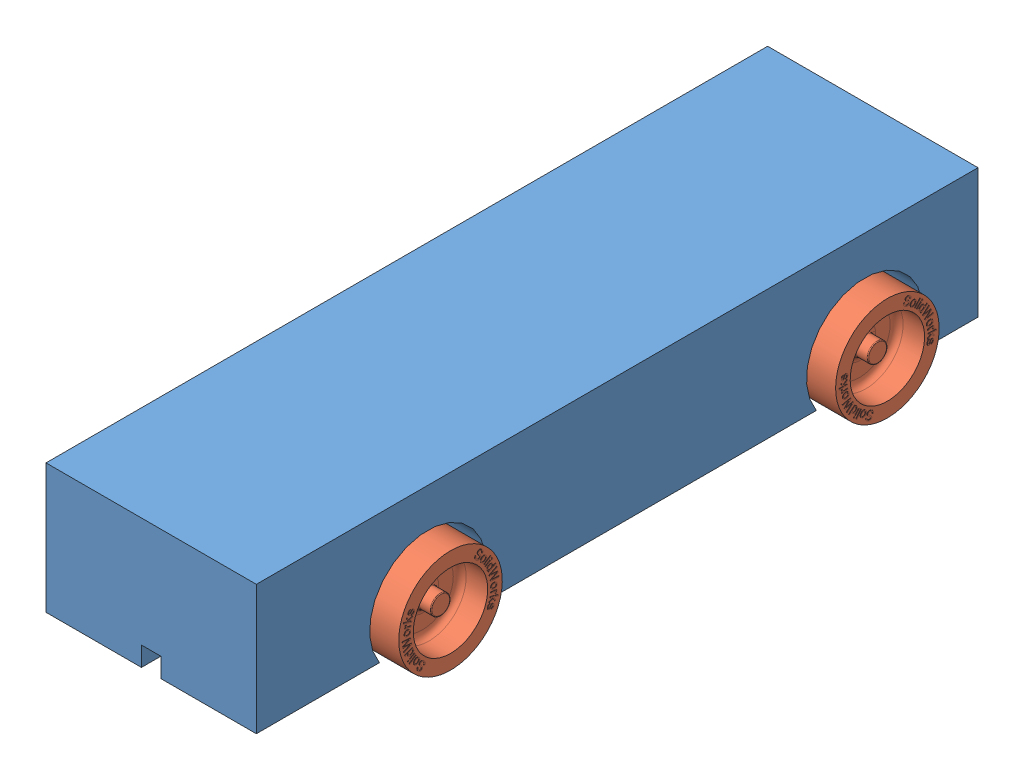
SolidWorks assembly Profil fastback.SLDASM, configuration Initial Block (file format 9000). Lengths in mm.
Overall size (79.2 52.56 223).
7 component instances, 3 part files, 12 mates.
Components (placement in the parent):
- Bloc fastback-1: Bloc fastback.SLDPRT [ Initial Body] at origin size (65 40 223)
- Wheel-1: Wheel.SLDPRT [Default] at (24.8525 10 170) x (1 0 0) z (0 0.444542 0.895758)
- Wheel-2: Wheel.SLDPRT [Default] at (24.8525 10 35) x (1 0 0) z (0 -0.19026 -0.981734)
- Wheel-3: Wheel.SLDPRT [Default] at (-24.8525 10 35) x (-1 0 0) z (0 -0.609723 -0.792615)
- Wheel-4: Wheel.SLDPRT [Default] at (-24.8525 10 170) x (-1 0 0) z (0 0.757905 -0.652365)
- Axle-3: Axle.SLDPRT [Default] at (-32.5 10 35) size (65 3 3)
- Axle-4: Axle.SLDPRT [Default] at (-32.5 10 170) size (65 3 3)
Mates (geometry in assembly coordinates):
- Coaxiale1: concentric anti-aligned: cylinder of Bloc fastback-1 through (-32.5 10 170) axis (1 0 0) radius 1.525; cylinder of Axle-4 through (32.5 10 170) axis (-1 0 0) radius 1.5
- Coïncidente1: coincident aligned: plane of Bloc fastback-1 through (-32.5 0 223) normal (-1 0 0); plane of Axle-4 through (-32.5 10 170) normal (-1 0 0)
- Coaxiale2: concentric anti-aligned: cylinder of Bloc fastback-1 through (-32.5 10 35) axis (1 0 0) radius 1.525; cylinder of Axle-3 through (32.5 10 35) axis (-1 0 0) radius 1.5
- Coïncidente2: coincident aligned: plane of Bloc fastback-1 through (-32.5 0 223) normal (-1 0 0); plane of Axle-3 through (-32.5 10 35) normal (-1 0 0)
- Coaxiale3: concentric anti-aligned: cylinder of Wheel-3 through (-24.8525 10 35) axis (1 0 0) radius 3.125; cylinder of Axle-3 through (32.5 10 35) axis (-1 0 0) radius 1.5
- Distance1: distance = 3 mm anti-aligned: plane of Bloc fastback-1 through (-17.5 10 35) normal (-1 0 0); plane of Wheel-3 through (-20.5 12.4769 33.0946) normal (1 0 0)
- Coaxiale4: concentric aligned: cylinder of Wheel-2 through (24.8525 10 35) axis (-1 0 0) radius 3.125; cylinder of Axle-3 through (32.5 10 35) axis (-1 0 0) radius 1.5
- Distance2: distance = 3 mm anti-aligned: plane of Wheel-2 through (20.5 6.9321 35.5946) normal (-1 0 0); plane of Bloc fastback-1 through (17.5 10 35) normal (1 0 0)
- Coaxiale5: concentric anti-aligned: cylinder of Wheel-4 through (-24.8525 10 170) axis (1 0 0) radius 3.125; cylinder of Axle-4 through (32.5 10 170) axis (-1 0 0) radius 1.5
- Distance4: distance = 3 mm anti-aligned: plane of Wheel-4 through (-20.5 12.0386 172.3685) normal (1 0 0); plane of Bloc fastback-1 through (-17.5 10 170) normal (-1 0 0)
- Coaxiale6: concentric aligned: cylinder of Wheel-1 through (24.8525 10 170) axis (-1 0 0) radius 3.125; cylinder of Axle-4 through (32.5 10 170) axis (-1 0 0) radius 1.5
- Distance5: distance = 3 mm anti-aligned: plane of Wheel-1 through (20.5 12.7992 168.6108) normal (-1 0 0); plane of Bloc fastback-1 through (17.5 10 170) normal (1 0 0)
